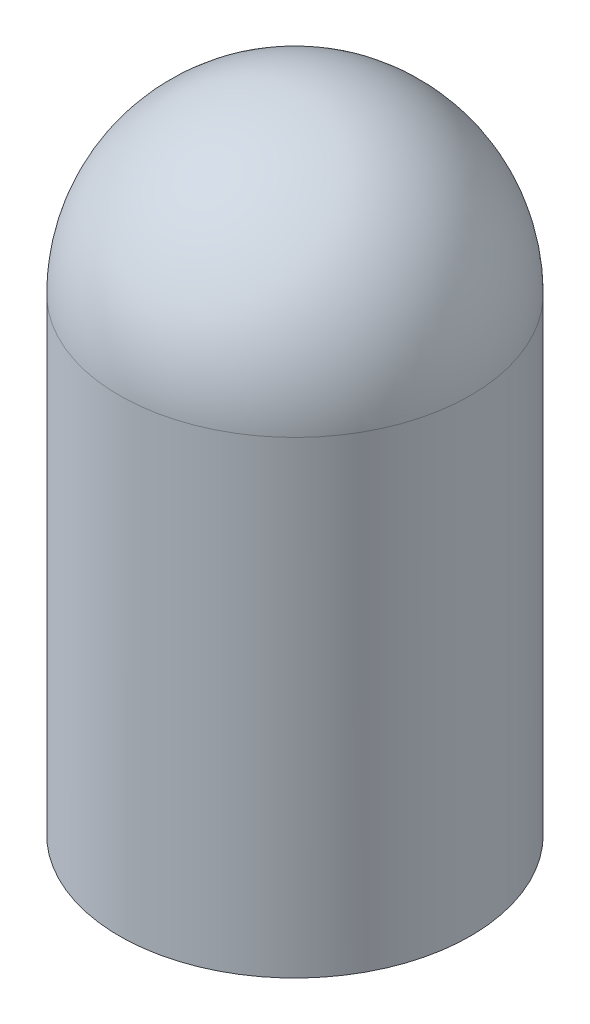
from build123d import *


with BuildPart() as part:
    # Esquisse1 → Base-R_vol.-Mince (revolve)
    with BuildSketch(Plane.XY):
        with BuildLine():
            Line((1.5, 0), (1.5, 4))
            ThreePointArc((1.5, 4), (1.060660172, 5.060660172), (0, 5.5))
            Line((0, 5.5), (0, 5.3))
            ThreePointArc((0, 5.3), (0.919238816, 4.919238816), (1.3, 4))
            Line((1.3, 4), (1.3, 0))
            Line((1.3, 0), (1.5, 0))
        make_face()
    revolve(axis=Axis((0, 0, 0), (0, 1, 0)))


solid = part.part
